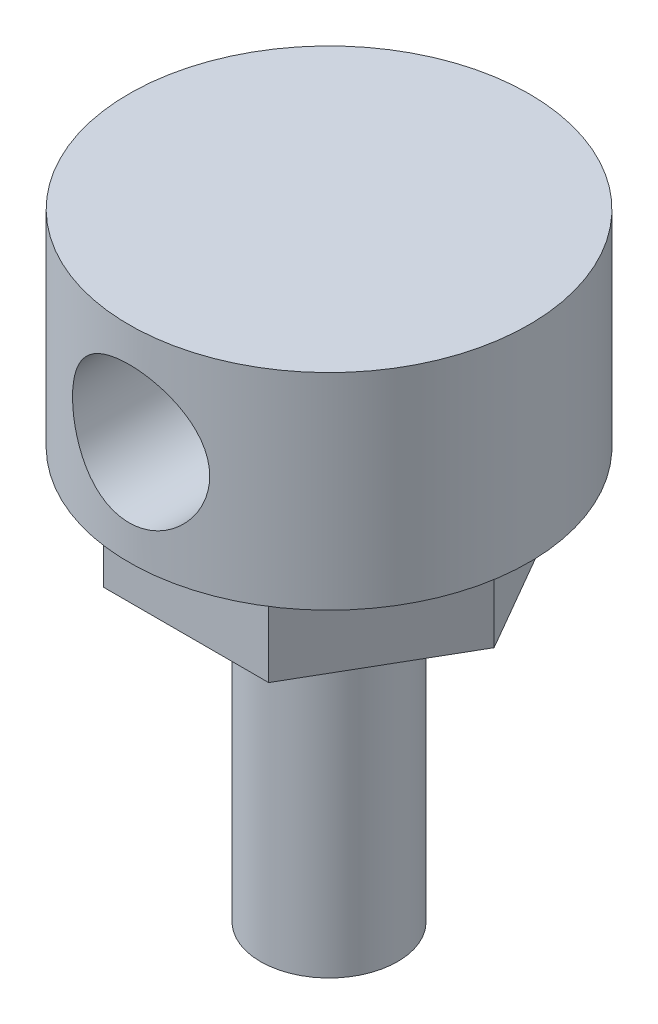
ISO-10303-21;
HEADER;
FILE_DESCRIPTION(('STEP AP214'),'2;1');
FILE_NAME('part.step','',(''),(''),'','','');
FILE_SCHEMA(('AUTOMOTIVE_DESIGN { 1 0 10303 214 1 1 1 1 }'));
ENDSEC;
DATA;
#1=APPLICATION_CONTEXT('core data for automotive mechanical design processes');
#2=APPLICATION_PROTOCOL_DEFINITION('international standard','automotive_design',2000,#1);
#3=PRODUCT_CONTEXT('',#1,'mechanical');
#4=PRODUCT('Part','Part','',(#3));
#5=PRODUCT_RELATED_PRODUCT_CATEGORY('part','',(#4));
#6=PRODUCT_DEFINITION_FORMATION('','',#4);
#7=PRODUCT_DEFINITION_CONTEXT('part definition',#1,'design');
#8=PRODUCT_DEFINITION('design','',#6,#7);
#9=PRODUCT_DEFINITION_SHAPE('','',#8);
#10=(LENGTH_UNIT() NAMED_UNIT(*) SI_UNIT(.MILLI.,.METRE.));
#11=(NAMED_UNIT(*) PLANE_ANGLE_UNIT() SI_UNIT($,.RADIAN.));
#12=(NAMED_UNIT(*) SI_UNIT($,.STERADIAN.) SOLID_ANGLE_UNIT());
#13=UNCERTAINTY_MEASURE_WITH_UNIT(LENGTH_MEASURE(1.E-05),#10,'distance_accuracy_value','');
#14=(GEOMETRIC_REPRESENTATION_CONTEXT(3) GLOBAL_UNCERTAINTY_ASSIGNED_CONTEXT((#13)) GLOBAL_UNIT_ASSIGNED_CONTEXT((#10,
#11,#12)) REPRESENTATION_CONTEXT('',''));
#15=CARTESIAN_POINT('',(0.,0.,0.));
#16=DIRECTION('',(0.,0.,1.));
#17=DIRECTION('',(1.,0.,0.));
#18=AXIS2_PLACEMENT_3D('',#15,#16,#17);
#19=CARTESIAN_POINT('',(7.21687836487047,8.,12.4999999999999));
#20=DIRECTION('',(-0.866025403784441,0.,-0.499999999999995));
#21=DIRECTION('',(-0.499999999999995,0.,0.866025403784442));
#22=AXIS2_PLACEMENT_3D('',#19,#20,#21);
#23=PLANE('',#22);
#24=DIRECTION('',(0.499999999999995,0.,-0.866025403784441));
#25=VECTOR('',#24,1.);
#26=CARTESIAN_POINT('',(7.21687836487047,0.,12.4999999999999));
#27=LINE('',#26,#25);
#28=CARTESIAN_POINT('',(7.21687836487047,0.,12.4999999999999));
#29=VERTEX_POINT('',#28);
#30=CARTESIAN_POINT('',(14.4337567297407,0.,0.));
#31=VERTEX_POINT('',#30);
#32=EDGE_CURVE('E144',#29,#31,#27,.T.);
#33=ORIENTED_EDGE('',*,*,#32,.T.);
#34=DIRECTION('',(0.,-1.,0.));
#35=VECTOR('',#34,1.);
#36=CARTESIAN_POINT('',(14.4337567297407,8.,0.));
#37=LINE('',#36,#35);
#38=CARTESIAN_POINT('',(14.4337567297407,8.,0.));
#39=VERTEX_POINT('',#38);
#40=EDGE_CURVE('E159',#39,#31,#37,.T.);
#41=ORIENTED_EDGE('',*,*,#40,.F.);
#42=DIRECTION('',(0.499999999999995,0.,-0.866025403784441));
#43=VECTOR('',#42,1.);
#44=CARTESIAN_POINT('',(7.21687836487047,8.,12.4999999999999));
#45=LINE('',#44,#43);
#46=CARTESIAN_POINT('',(7.21687836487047,8.,12.4999999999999));
#47=VERTEX_POINT('',#46);
#48=EDGE_CURVE('E135',#47,#39,#45,.T.);
#49=ORIENTED_EDGE('',*,*,#48,.F.);
#50=DIRECTION('',(0.,-1.,0.));
#51=VECTOR('',#50,1.);
#52=CARTESIAN_POINT('',(7.21687836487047,8.,12.4999999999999));
#53=LINE('',#52,#51);
#54=EDGE_CURVE('E143',#47,#29,#53,.T.);
#55=ORIENTED_EDGE('',*,*,#54,.T.);
#56=EDGE_LOOP('',(#33,#41,#49,#55));
#57=FACE_BOUND('',#56,.T.);
#58=ADVANCED_FACE('F46',(#57),#23,.F.);
#59=CARTESIAN_POINT('',(14.4337567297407,8.,0.));
#60=DIRECTION('',(-0.866025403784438,0.,0.500000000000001));
#61=DIRECTION('',(0.500000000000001,0.,0.866025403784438));
#62=AXIS2_PLACEMENT_3D('',#59,#60,#61);
#63=PLANE('',#62);
#64=DIRECTION('',(-0.500000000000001,0.,-0.866025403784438));
#65=VECTOR('',#64,1.);
#66=CARTESIAN_POINT('',(14.4337567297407,0.,0.));
#67=LINE('',#66,#65);
#68=CARTESIAN_POINT('',(7.2168783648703,0.,-12.5));
#69=VERTEX_POINT('',#68);
#70=EDGE_CURVE('E147',#31,#69,#67,.T.);
#71=ORIENTED_EDGE('',*,*,#70,.T.);
#72=DIRECTION('',(0.,-1.,0.));
#73=VECTOR('',#72,1.);
#74=CARTESIAN_POINT('',(7.2168783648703,8.,-12.5));
#75=LINE('',#74,#73);
#76=CARTESIAN_POINT('',(7.2168783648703,8.,-12.5));
#77=VERTEX_POINT('',#76);
#78=EDGE_CURVE('E122',#77,#69,#75,.T.);
#79=ORIENTED_EDGE('',*,*,#78,.F.);
#80=DIRECTION('',(-0.500000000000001,0.,-0.866025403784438));
#81=VECTOR('',#80,1.);
#82=CARTESIAN_POINT('',(14.4337567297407,8.,0.));
#83=LINE('',#82,#81);
#84=EDGE_CURVE('E103',#39,#77,#83,.T.);
#85=ORIENTED_EDGE('',*,*,#84,.F.);
#86=ORIENTED_EDGE('',*,*,#40,.T.);
#87=EDGE_LOOP('',(#71,#79,#85,#86));
#88=FACE_BOUND('',#87,.T.);
#89=ADVANCED_FACE('F199',(#88),#63,.F.);
#90=CARTESIAN_POINT('',(7.2168783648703,8.,-12.5));
#91=DIRECTION('',(0.,0.,1.));
#92=DIRECTION('',(1.,0.,0.));
#93=AXIS2_PLACEMENT_3D('',#90,#91,#92);
#94=PLANE('',#93);
#95=DIRECTION('',(-1.,0.,0.));
#96=VECTOR('',#95,1.);
#97=CARTESIAN_POINT('',(7.2168783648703,0.,-12.5));
#98=LINE('',#97,#96);
#99=CARTESIAN_POINT('',(-7.21687836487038,0.,-12.5));
#100=VERTEX_POINT('',#99);
#101=EDGE_CURVE('E119',#69,#100,#98,.T.);
#102=ORIENTED_EDGE('',*,*,#101,.T.);
#103=DIRECTION('',(0.,-1.,0.));
#104=VECTOR('',#103,1.);
#105=CARTESIAN_POINT('',(-7.21687836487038,8.,-12.5));
#106=LINE('',#105,#104);
#107=CARTESIAN_POINT('',(-7.21687836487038,8.,-12.5));
#108=VERTEX_POINT('',#107);
#109=EDGE_CURVE('E112',#108,#100,#106,.T.);
#110=ORIENTED_EDGE('',*,*,#109,.F.);
#111=DIRECTION('',(-1.,0.,0.));
#112=VECTOR('',#111,1.);
#113=CARTESIAN_POINT('',(7.2168783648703,8.,-12.5));
#114=LINE('',#113,#112);
#115=EDGE_CURVE('E117',#77,#108,#114,.T.);
#116=ORIENTED_EDGE('',*,*,#115,.F.);
#117=ORIENTED_EDGE('',*,*,#78,.T.);
#118=EDGE_LOOP('',(#102,#110,#116,#117));
#119=FACE_BOUND('',#118,.T.);
#120=ADVANCED_FACE('F114',(#119),#94,.F.);
#121=CARTESIAN_POINT('',(-7.21687836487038,8.,-12.5));
#122=DIRECTION('',(0.866025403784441,0.,0.499999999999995));
#123=DIRECTION('',(0.499999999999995,0.,-0.866025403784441));
#124=AXIS2_PLACEMENT_3D('',#121,#122,#123);
#125=PLANE('',#124);
#126=DIRECTION('',(-0.499999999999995,0.,0.866025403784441));
#127=VECTOR('',#126,1.);
#128=CARTESIAN_POINT('',(-7.21687836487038,0.,-12.5));
#129=LINE('',#128,#127);
#130=CARTESIAN_POINT('',(-14.4337567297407,0.,1.00790384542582E-13));
#131=VERTEX_POINT('',#130);
#132=EDGE_CURVE('E151',#100,#131,#129,.T.);
#133=ORIENTED_EDGE('',*,*,#132,.T.);
#134=DIRECTION('',(0.,-1.,0.));
#135=VECTOR('',#134,1.);
#136=CARTESIAN_POINT('',(-14.4337567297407,8.,1.00790384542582E-13));
#137=LINE('',#136,#135);
#138=CARTESIAN_POINT('',(-14.4337567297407,8.,1.00790384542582E-13));
#139=VERTEX_POINT('',#138);
#140=EDGE_CURVE('E123',#139,#131,#137,.T.);
#141=ORIENTED_EDGE('',*,*,#140,.F.);
#142=DIRECTION('',(-0.499999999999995,0.,0.866025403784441));
#143=VECTOR('',#142,1.);
#144=CARTESIAN_POINT('',(-7.21687836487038,8.,-12.5));
#145=LINE('',#144,#143);
#146=EDGE_CURVE('E126',#108,#139,#145,.T.);
#147=ORIENTED_EDGE('',*,*,#146,.F.);
#148=ORIENTED_EDGE('',*,*,#109,.T.);
#149=EDGE_LOOP('',(#133,#141,#147,#148));
#150=FACE_BOUND('',#149,.T.);
#151=ADVANCED_FACE('F127',(#150),#125,.F.);
#152=CARTESIAN_POINT('',(-14.4337567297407,8.,1.00790384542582E-13));
#153=DIRECTION('',(0.866025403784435,0.,-0.500000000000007));
#154=DIRECTION('',(-0.500000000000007,0.,-0.866025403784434));
#155=AXIS2_PLACEMENT_3D('',#152,#153,#154);
#156=PLANE('',#155);
#157=DIRECTION('',(0.500000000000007,0.,0.866025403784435));
#158=VECTOR('',#157,1.);
#159=CARTESIAN_POINT('',(-14.4337567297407,0.,1.00790384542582E-13));
#160=LINE('',#159,#158);
#161=CARTESIAN_POINT('',(-7.21687836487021,0.,12.5000000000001));
#162=VERTEX_POINT('',#161);
#163=EDGE_CURVE('E88',#131,#162,#160,.T.);
#164=ORIENTED_EDGE('',*,*,#163,.T.);
#165=DIRECTION('',(0.,-1.,0.));
#166=VECTOR('',#165,1.);
#167=CARTESIAN_POINT('',(-7.21687836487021,8.,12.5000000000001));
#168=LINE('',#167,#166);
#169=CARTESIAN_POINT('',(-7.21687836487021,8.,12.5000000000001));
#170=VERTEX_POINT('',#169);
#171=EDGE_CURVE('E66',#170,#162,#168,.T.);
#172=ORIENTED_EDGE('',*,*,#171,.F.);
#173=DIRECTION('',(0.500000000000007,0.,0.866025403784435));
#174=VECTOR('',#173,1.);
#175=CARTESIAN_POINT('',(-14.4337567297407,8.,1.00790384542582E-13));
#176=LINE('',#175,#174);
#177=EDGE_CURVE('E130',#139,#170,#176,.T.);
#178=ORIENTED_EDGE('',*,*,#177,.F.);
#179=ORIENTED_EDGE('',*,*,#140,.T.);
#180=EDGE_LOOP('',(#164,#172,#178,#179));
#181=FACE_BOUND('',#180,.T.);
#182=ADVANCED_FACE('F207',(#181),#156,.F.);
#183=CARTESIAN_POINT('',(-7.21687836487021,8.,12.5000000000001));
#184=DIRECTION('',(0.,0.,-1.));
#185=DIRECTION('',(-1.,0.,0.));
#186=AXIS2_PLACEMENT_3D('',#183,#184,#185);
#187=PLANE('',#186);
#188=DIRECTION('',(1.,0.,0.));
#189=VECTOR('',#188,1.);
#190=CARTESIAN_POINT('',(-7.21687836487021,0.,12.5000000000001));
#191=LINE('',#190,#189);
#192=EDGE_CURVE('E94',#162,#29,#191,.T.);
#193=ORIENTED_EDGE('',*,*,#192,.T.);
#194=ORIENTED_EDGE('',*,*,#54,.F.);
#195=DIRECTION('',(1.,0.,0.));
#196=VECTOR('',#195,1.);
#197=CARTESIAN_POINT('',(-7.21687836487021,8.,12.5000000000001));
#198=LINE('',#197,#196);
#199=EDGE_CURVE('E140',#170,#47,#198,.T.);
#200=ORIENTED_EDGE('',*,*,#199,.F.);
#201=ORIENTED_EDGE('',*,*,#171,.T.);
#202=EDGE_LOOP('',(#193,#194,#200,#201));
#203=FACE_BOUND('',#202,.T.);
#204=ADVANCED_FACE('F195',(#203),#187,.F.);
#205=CARTESIAN_POINT('',(0.,0.,0.));
#206=DIRECTION('',(0.,1.,0.));
#207=DIRECTION('',(0.,0.,1.));
#208=AXIS2_PLACEMENT_3D('',#205,#206,#207);
#209=PLANE('',#208);
#210=CARTESIAN_POINT('',(0.,0.,0.));
#211=DIRECTION('',(0.,1.,0.));
#212=DIRECTION('',(0.,0.,1.));
#213=AXIS2_PLACEMENT_3D('',#210,#211,#212);
#214=CIRCLE('',#213,6.);
#215=CARTESIAN_POINT('',(0.,0.,6.));
#216=VERTEX_POINT('',#215);
#217=EDGE_CURVE('E306',#216,#216,#214,.T.);
#218=ORIENTED_EDGE('',*,*,#217,.T.);
#219=EDGE_LOOP('',(#218));
#220=FACE_BOUND('',#219,.T.);
#221=ORIENTED_EDGE('',*,*,#32,.F.);
#222=ORIENTED_EDGE('',*,*,#192,.F.);
#223=ORIENTED_EDGE('',*,*,#163,.F.);
#224=ORIENTED_EDGE('',*,*,#132,.F.);
#225=ORIENTED_EDGE('',*,*,#101,.F.);
#226=ORIENTED_EDGE('',*,*,#70,.F.);
#227=EDGE_LOOP('',(#221,#222,#223,#224,#225,#226));
#228=FACE_BOUND('',#227,.T.);
#229=ADVANCED_FACE('F188',(#220,#228),#209,.F.);
#230=CARTESIAN_POINT('',(0.,8.,0.));
#231=DIRECTION('',(0.,-1.,0.));
#232=DIRECTION('',(0.,0.,-1.));
#233=AXIS2_PLACEMENT_3D('',#230,#231,#232);
#234=PLANE('',#233);
#235=CARTESIAN_POINT('',(0.,8.,0.));
#236=DIRECTION('',(0.,-1.,0.));
#237=DIRECTION('',(0.,0.,-1.));
#238=AXIS2_PLACEMENT_3D('',#235,#236,#237);
#239=CIRCLE('',#238,17.5);
#240=CARTESIAN_POINT('',(0.,8.,-17.5));
#241=VERTEX_POINT('',#240);
#242=EDGE_CURVE('E312',#241,#241,#239,.T.);
#243=ORIENTED_EDGE('',*,*,#242,.T.);
#244=EDGE_LOOP('',(#243));
#245=FACE_BOUND('',#244,.T.);
#246=ORIENTED_EDGE('',*,*,#48,.T.);
#247=ORIENTED_EDGE('',*,*,#84,.T.);
#248=ORIENTED_EDGE('',*,*,#115,.T.);
#249=ORIENTED_EDGE('',*,*,#146,.T.);
#250=ORIENTED_EDGE('',*,*,#177,.T.);
#251=ORIENTED_EDGE('',*,*,#199,.T.);
#252=EDGE_LOOP('',(#246,#247,#248,#249,#250,#251));
#253=FACE_BOUND('',#252,.T.);
#254=ADVANCED_FACE('F133',(#245,#253),#234,.T.);
#255=CARTESIAN_POINT('',(0.,26.,0.));
#256=DIRECTION('',(0.,-1.,0.));
#257=DIRECTION('',(0.,0.,-1.));
#258=AXIS2_PLACEMENT_3D('',#255,#256,#257);
#259=CYLINDRICAL_SURFACE('',#258,17.5);
#260=CARTESIAN_POINT('',(0.,23.,-17.5));
#261=CARTESIAN_POINT('',(0.163389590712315,23.000000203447,-17.5000001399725));
#262=CARTESIAN_POINT('',(0.326776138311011,22.9933206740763,-17.4977065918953));
#263=CARTESIAN_POINT('',(0.652391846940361,22.9666638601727,-17.488594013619));
#264=CARTESIAN_POINT('',(0.814620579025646,22.9466818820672,-17.4817733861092));
#265=CARTESIAN_POINT('',(1.13661475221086,22.8936171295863,-17.4637940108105));
#266=CARTESIAN_POINT('',(1.29638103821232,22.860538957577,-17.452636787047));
#267=CARTESIAN_POINT('',(1.61243727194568,22.7815732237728,-17.4262791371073));
#268=CARTESIAN_POINT('',(1.76872584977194,22.7356807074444,-17.4110771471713));
#269=CARTESIAN_POINT('',(2.07636915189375,22.6316076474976,-17.3770708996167));
#270=CARTESIAN_POINT('',(2.22773376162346,22.5734537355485,-17.3582744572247));
#271=CARTESIAN_POINT('',(2.52496271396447,22.4452520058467,-17.3175366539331));
#272=CARTESIAN_POINT('',(2.6708249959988,22.375199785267,-17.2955941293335));
#273=CARTESIAN_POINT('',(2.95607249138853,22.2237635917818,-17.2491308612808));
#274=CARTESIAN_POINT('',(3.09545894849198,22.1423818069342,-17.2246106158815));
#275=CARTESIAN_POINT('',(3.36702141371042,21.9688173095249,-17.1735920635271));
#276=CARTESIAN_POINT('',(3.49919480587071,21.8766307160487,-17.1470930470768));
#277=CARTESIAN_POINT('',(3.75971990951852,21.6789009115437,-17.091893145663));
#278=CARTESIAN_POINT('',(3.88780616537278,21.5730200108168,-17.0631486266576));
#279=CARTESIAN_POINT('',(4.13468315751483,21.3510858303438,-17.0050134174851));
#280=CARTESIAN_POINT('',(4.25347367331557,21.2350323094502,-16.9756227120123));
#281=CARTESIAN_POINT('',(4.48109269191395,20.9934153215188,-16.9169627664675));
#282=CARTESIAN_POINT('',(4.58991719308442,20.8678480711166,-16.8876935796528));
#283=CARTESIAN_POINT('',(4.79683730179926,20.6080358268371,-16.8300886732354));
#284=CARTESIAN_POINT('',(4.8949365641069,20.4737938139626,-16.8017526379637));
#285=CARTESIAN_POINT('',(5.08268823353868,20.1930667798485,-16.7459300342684));
#286=CARTESIAN_POINT('',(5.17198146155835,20.0463304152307,-16.7184975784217));
#287=CARTESIAN_POINT('',(5.3377987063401,19.7454327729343,-16.6662971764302));
#288=CARTESIAN_POINT('',(5.41432777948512,19.5912744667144,-16.641528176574));
#289=CARTESIAN_POINT('',(5.55403069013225,19.2764881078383,-16.5954258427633));
#290=CARTESIAN_POINT('',(5.61720233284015,19.1158589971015,-16.5740930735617));
#291=CARTESIAN_POINT('',(5.72956595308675,18.7893746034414,-16.5355860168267));
#292=CARTESIAN_POINT('',(5.77876437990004,18.6235217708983,-16.5184098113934));
#293=CARTESIAN_POINT('',(5.86125718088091,18.293657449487,-16.4893150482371));
#294=CARTESIAN_POINT('',(5.8950474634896,18.1297843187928,-16.4772336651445));
#295=CARTESIAN_POINT('',(5.94883595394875,17.7995745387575,-16.4578908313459));
#296=CARTESIAN_POINT('',(5.96883997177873,17.6332389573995,-16.4506273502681));
#297=CARTESIAN_POINT('',(5.9948669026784,17.299347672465,-16.4411606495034));
#298=CARTESIAN_POINT('',(6.00089101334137,17.1317920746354,-16.4389569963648));
#299=CARTESIAN_POINT('',(5.99889639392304,16.7967783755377,-16.4396850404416));
#300=CARTESIAN_POINT('',(5.99087809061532,16.6293202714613,-16.4426165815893));
#301=CARTESIAN_POINT('',(5.9616221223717,16.3040000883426,-16.4532454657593));
#302=CARTESIAN_POINT('',(5.94105099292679,16.146069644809,-16.4607024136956));
#303=CARTESIAN_POINT('',(5.88747410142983,15.8325461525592,-16.4799410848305));
#304=CARTESIAN_POINT('',(5.85446416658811,15.676953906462,-16.4917242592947));
#305=CARTESIAN_POINT('',(5.77631897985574,15.3692547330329,-16.5192569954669));
#306=CARTESIAN_POINT('',(5.73118707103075,15.2171468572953,-16.5350054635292));
#307=CARTESIAN_POINT('',(5.62915620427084,14.917287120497,-16.5700183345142));
#308=CARTESIAN_POINT('',(5.57225277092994,14.769536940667,-16.5892840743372));
#309=CARTESIAN_POINT('',(5.44610761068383,14.4769652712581,-16.6311273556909));
#310=CARTESIAN_POINT('',(5.37667900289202,14.3322314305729,-16.6537539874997));
#311=CARTESIAN_POINT('',(5.22662395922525,14.0490528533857,-16.7014549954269));
#312=CARTESIAN_POINT('',(5.14599370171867,13.9106102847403,-16.726530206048));
#313=CARTESIAN_POINT('',(4.97409227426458,13.6408348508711,-16.7784524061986));
#314=CARTESIAN_POINT('',(4.88282026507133,13.5095025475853,-16.8052995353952));
#315=CARTESIAN_POINT('',(4.69020928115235,13.2546764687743,-16.8600699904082));
#316=CARTESIAN_POINT('',(4.58886992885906,13.1311829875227,-16.887993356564));
#317=CARTESIAN_POINT('',(4.37080702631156,12.8860688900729,-16.9457800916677));
#318=CARTESIAN_POINT('',(4.25354109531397,12.764935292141,-16.9756649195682));
#319=CARTESIAN_POINT('',(4.00922102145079,12.5329521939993,-17.0350210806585));
#320=CARTESIAN_POINT('',(3.88216995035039,12.4220994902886,-17.0644925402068));
#321=CARTESIAN_POINT('',(3.61895574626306,12.2113049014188,-17.1222463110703));
#322=CARTESIAN_POINT('',(3.48278820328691,12.1113683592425,-17.1505280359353));
#323=CARTESIAN_POINT('',(3.20229046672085,11.9232052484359,-17.2051079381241));
#324=CARTESIAN_POINT('',(3.05796354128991,11.8349740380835,-17.2314068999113));
#325=CARTESIAN_POINT('',(2.76030824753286,11.6698977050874,-17.2816010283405));
#326=CARTESIAN_POINT('',(2.606895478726,11.5931951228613,-17.3054650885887));
#327=CARTESIAN_POINT('',(2.29370601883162,11.4530792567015,-17.3497524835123));
#328=CARTESIAN_POINT('',(2.13393183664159,11.3896607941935,-17.3701771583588));
#329=CARTESIAN_POINT('',(1.80912555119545,11.2766593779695,-17.4070035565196));
#330=CARTESIAN_POINT('',(1.64409395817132,11.2270750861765,-17.423405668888));
#331=CARTESIAN_POINT('',(1.31001358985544,11.1422220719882,-17.4517036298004));
#332=CARTESIAN_POINT('',(1.14096501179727,11.1069526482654,-17.4635996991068));
#333=CARTESIAN_POINT('',(0.80796141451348,11.0523654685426,-17.4820974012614));
#334=CARTESIAN_POINT('',(0.644125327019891,11.0323940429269,-17.4889155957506));
#335=CARTESIAN_POINT('',(0.315240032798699,11.0060166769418,-17.4979336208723));
#336=CARTESIAN_POINT('',(0.150190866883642,10.9996102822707,-17.5001336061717));
#337=CARTESIAN_POINT('',(-0.179842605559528,11.0004263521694,-17.4998538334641));
#338=CARTESIAN_POINT('',(-0.344826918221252,11.0076466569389,-17.497374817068));
#339=CARTESIAN_POINT('',(-0.673505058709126,11.0356397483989,-17.487807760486));
#340=CARTESIAN_POINT('',(-0.837198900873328,11.0564123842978,-17.4807197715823));
#341=CARTESIAN_POINT('',(-1.1569991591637,11.1104476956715,-17.4624226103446));
#342=CARTESIAN_POINT('',(-1.31318291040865,11.1433002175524,-17.4513489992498));
#343=CARTESIAN_POINT('',(-1.62218787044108,11.2212540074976,-17.4253423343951));
#344=CARTESIAN_POINT('',(-1.7750079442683,11.2663593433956,-17.4104079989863));
#345=CARTESIAN_POINT('',(-2.07619695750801,11.3684208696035,-17.3770641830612));
#346=CARTESIAN_POINT('',(-2.22456708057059,11.4253738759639,-17.3586556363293));
#347=CARTESIAN_POINT('',(-2.51603746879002,11.5507126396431,-17.31881065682));
#348=CARTESIAN_POINT('',(-2.65913571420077,11.6191027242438,-17.2973730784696));
#349=CARTESIAN_POINT('',(-2.94291064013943,11.7687771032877,-17.2513908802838));
#350=CARTESIAN_POINT('',(-3.08342026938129,11.8503572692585,-17.2267785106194));
#351=CARTESIAN_POINT('',(-3.35715286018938,12.0244751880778,-17.1755327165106));
#352=CARTESIAN_POINT('',(-3.49037328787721,12.1170167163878,-17.1488985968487));
#353=CARTESIAN_POINT('',(-3.74873071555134,12.312436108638,-17.0942813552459));
#354=CARTESIAN_POINT('',(-3.87386683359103,12.4153150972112,-17.0662980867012));
#355=CARTESIAN_POINT('',(-4.11533777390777,12.6307690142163,-17.0096848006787));
#356=CARTESIAN_POINT('',(-4.23167234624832,12.7433442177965,-16.9810547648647));
#357=CARTESIAN_POINT('',(-4.46028931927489,12.9832125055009,-16.922482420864));
#358=CARTESIAN_POINT('',(-4.57210228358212,13.1109544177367,-16.892543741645));
#359=CARTESIAN_POINT('',(-4.78456373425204,13.3755376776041,-16.8336004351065));
#360=CARTESIAN_POINT('',(-4.8852158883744,13.5123760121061,-16.8045955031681));
#361=CARTESIAN_POINT('',(-5.07474821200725,13.7944098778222,-16.7483345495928));
#362=CARTESIAN_POINT('',(-5.16362325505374,13.9396090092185,-16.7210792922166));
#363=CARTESIAN_POINT('',(-5.32884966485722,14.2373323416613,-16.6691589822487));
#364=CARTESIAN_POINT('',(-5.40520626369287,14.3898534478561,-16.6444928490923));
#365=CARTESIAN_POINT('',(-5.5447830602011,14.7012022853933,-16.5985174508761));
#366=CARTESIAN_POINT('',(-5.60800916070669,14.8600271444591,-16.5772066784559));
#367=CARTESIAN_POINT('',(-5.72077524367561,15.1828724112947,-16.5386300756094));
#368=CARTESIAN_POINT('',(-5.7703208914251,15.3468906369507,-16.5213625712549));
#369=CARTESIAN_POINT('',(-5.85526622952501,15.6789331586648,-16.4914489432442));
#370=CARTESIAN_POINT('',(-5.89066871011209,15.8469566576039,-16.4788019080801));
#371=CARTESIAN_POINT('',(-5.94696706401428,16.1857153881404,-16.4585686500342));
#372=CARTESIAN_POINT('',(-5.9678637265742,16.3564504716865,-16.4509821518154));
#373=CARTESIAN_POINT('',(-5.99418547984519,16.6898901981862,-16.4414087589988));
#374=CARTESIAN_POINT('',(-6.00039147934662,16.8525255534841,-16.4391393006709));
#375=CARTESIAN_POINT('',(-5.99957016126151,17.1778162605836,-16.4394391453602));
#376=CARTESIAN_POINT('',(-5.99253835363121,17.3404716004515,-16.4420100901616));
#377=CARTESIAN_POINT('',(-5.96530939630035,17.6644548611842,-16.4519084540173));
#378=CARTESIAN_POINT('',(-5.94511808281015,17.8257833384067,-16.4592337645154));
#379=CARTESIAN_POINT('',(-5.8917650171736,18.1460681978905,-16.478407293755));
#380=CARTESIAN_POINT('',(-5.85859839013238,18.3050236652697,-16.4902572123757));
#381=CARTESIAN_POINT('',(-5.78046684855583,18.6159646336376,-16.5178048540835));
#382=CARTESIAN_POINT('',(-5.7357737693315,18.7680265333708,-16.5334134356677));
#383=CARTESIAN_POINT('',(-5.63463461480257,19.0678323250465,-16.5681547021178));
#384=CARTESIAN_POINT('',(-5.57818438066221,19.2155746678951,-16.5872886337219));
#385=CARTESIAN_POINT('',(-5.45399262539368,19.5057673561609,-16.6285369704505));
#386=CARTESIAN_POINT('',(-5.38625307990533,19.6482186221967,-16.6506508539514));
#387=CARTESIAN_POINT('',(-5.23993629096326,19.9270929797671,-16.6972741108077));
#388=CARTESIAN_POINT('',(-5.16135514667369,20.0635138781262,-16.7217843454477));
#389=CARTESIAN_POINT('',(-4.9900743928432,20.3355899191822,-16.773715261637));
#390=CARTESIAN_POINT('',(-4.89689494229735,20.4709275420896,-16.8012176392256));
#391=CARTESIAN_POINT('',(-4.69988721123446,20.7333609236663,-16.8573885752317));
#392=CARTESIAN_POINT('',(-4.59605853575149,20.8604563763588,-16.8860571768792));
#393=CARTESIAN_POINT('',(-4.37834895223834,21.1057227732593,-16.943811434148));
#394=CARTESIAN_POINT('',(-4.26446377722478,21.2238898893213,-16.9728972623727));
#395=CARTESIAN_POINT('',(-4.02739221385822,21.4505048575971,-17.0307073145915));
#396=CARTESIAN_POINT('',(-3.90420885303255,21.5589558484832,-17.0594316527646));
#397=CARTESIAN_POINT('',(-3.64378228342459,21.7699175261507,-17.1169909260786));
#398=CARTESIAN_POINT('',(-3.50616368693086,21.8719784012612,-17.1457784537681));
#399=CARTESIAN_POINT('',(-3.22247595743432,22.0640876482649,-17.2013525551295));
#400=CARTESIAN_POINT('',(-3.07641000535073,22.1541405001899,-17.2281398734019));
#401=CARTESIAN_POINT('',(-2.77668905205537,22.321604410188,-17.2789786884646));
#402=CARTESIAN_POINT('',(-2.62303200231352,22.3990120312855,-17.3030294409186));
#403=CARTESIAN_POINT('',(-2.30928262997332,22.5404702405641,-17.3476887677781));
#404=CARTESIAN_POINT('',(-2.14919319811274,22.6045267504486,-17.3682988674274));
#405=CARTESIAN_POINT('',(-1.82776727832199,22.7173019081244,-17.405021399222));
#406=CARTESIAN_POINT('',(-1.66656335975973,22.7663657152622,-17.4212338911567));
#407=CARTESIAN_POINT('',(-1.34030929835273,22.8508076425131,-17.4493657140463));
#408=CARTESIAN_POINT('',(-1.1752607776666,22.8861914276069,-17.4612868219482));
#409=CARTESIAN_POINT('',(-0.84251523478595,22.9429497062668,-17.4805016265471));
#410=CARTESIAN_POINT('',(-0.674818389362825,22.9643251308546,-17.4877956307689));
#411=CARTESIAN_POINT('',(-0.338079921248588,22.9928499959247,-17.4975446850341));
#412=CARTESIAN_POINT('',(-0.169038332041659,22.9999997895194,-17.4999998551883));
#413=CARTESIAN_POINT('',(0.,23.,-17.5));
#414=B_SPLINE_CURVE_WITH_KNOTS('',3,(#260,#261,#262,#263,#264,#265,#266,#267,#268,#269,#270,
#271,#272,#273,#274,#275,#276,#277,#278,#279,#280,#281,#282,#283,#284,#285,#286,#287,#288,#289,
#290,#291,#292,#293,#294,#295,#296,#297,#298,#299,#300,#301,#302,#303,#304,#305,#306,#307,#308,
#309,#310,#311,#312,#313,#314,#315,#316,#317,#318,#319,#320,#321,#322,#323,#324,#325,#326,#327,
#328,#329,#330,#331,#332,#333,#334,#335,#336,#337,#338,#339,#340,#341,#342,#343,#344,#345,#346,
#347,#348,#349,#350,#351,#352,#353,#354,#355,#356,#357,#358,#359,#360,#361,#362,#363,#364,#365,
#366,#367,#368,#369,#370,#371,#372,#373,#374,#375,#376,#377,#378,#379,#380,#381,#382,#383,#384,
#385,#386,#387,#388,#389,#390,#391,#392,#393,#394,#395,#396,#397,#398,#399,#400,#401,#402,#403,
#404,#405,#406,#407,#408,#409,#410,#411,#412,#413),.UNSPECIFIED.,.T.,.F.,(4,2,2,2,2,2,2,2,2,2,2,
2,2,2,2,2,2,2,2,2,2,2,2,2,2,2,2,2,2,2,2,2,2,2,2,2,2,2,2,2,2,2,2,2,2,2,2,2,2,2,2,2,2,2,2,2,2,2,2,
2,2,2,2,2,2,2,2,2,2,2,2,2,2,2,2,2,4),(0.,0.490011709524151,0.980196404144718,1.47020898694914,
1.9604112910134,2.44955964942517,2.93888940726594,3.42812479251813,3.91753644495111,
4.4229186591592,4.92831285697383,5.4339091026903,5.93933251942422,6.46053012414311,
6.98152076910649,7.50259695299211,8.02343224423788,8.52605774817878,9.02847129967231,
9.5308418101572,10.033197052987,10.5109535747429,10.9888705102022,11.4666557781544,
11.9446230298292,12.4304215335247,12.9163861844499,13.402389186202,13.8884104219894,
14.4014894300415,14.9144080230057,15.4275765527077,15.940540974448,16.4594018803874,
16.9780601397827,17.4966682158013,18.0152508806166,18.5102019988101,19.0051365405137,
19.4999926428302,19.9948432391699,20.4742457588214,20.9538076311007,21.4332407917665,
21.9128557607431,22.4052946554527,22.8979036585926,23.3905663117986,23.8832429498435,
24.3997905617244,24.9161679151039,25.4327693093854,25.9491542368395,26.4653065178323,
26.9812447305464,27.4970811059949,28.0128894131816,28.5005949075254,28.9884658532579,
29.4761205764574,29.9639586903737,30.4412035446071,30.9186175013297,31.3959479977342,
31.8734506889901,32.3726889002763,32.8719456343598,33.3714152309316,33.870722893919,
34.3912991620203,34.9116806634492,35.4322033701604,35.9524947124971,36.459703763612,
36.9667025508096,37.4736676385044,37.9806201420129),.UNSPECIFIED.);
#415=CARTESIAN_POINT('',(0.,23.,-17.5));
#416=VERTEX_POINT('',#415);
#417=EDGE_CURVE('E13',#416,#416,#414,.T.);
#418=ORIENTED_EDGE('',*,*,#417,.F.);
#419=EDGE_LOOP('',(#418));
#420=FACE_BOUND('',#419,.T.);
#421=CARTESIAN_POINT('',(6.,17.,16.4392822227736));
#422=CARTESIAN_POINT('',(6.0000002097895,17.1630704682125,16.4392820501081));
#423=CARTESIAN_POINT('',(5.99334652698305,17.326137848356,16.4417151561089));
#424=CARTESIAN_POINT('',(5.96679536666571,17.6511061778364,16.4513693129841));
#425=CARTESIAN_POINT('',(5.94689317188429,17.8130066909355,16.4585920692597));
#426=CARTESIAN_POINT('',(5.8940459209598,18.1343405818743,16.4775910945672));
#427=CARTESIAN_POINT('',(5.8611046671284,18.2937746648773,16.4893660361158));
#428=CARTESIAN_POINT('',(5.78247648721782,18.6091579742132,16.5171032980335));
#429=CARTESIAN_POINT('',(5.73678456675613,18.7651058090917,16.5330672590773));
#430=CARTESIAN_POINT('',(5.63319566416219,19.0720219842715,16.5686479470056));
#431=CARTESIAN_POINT('',(5.57532925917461,19.2230017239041,16.5882555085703));
#432=CARTESIAN_POINT('',(5.4477724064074,19.5194902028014,16.6305829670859));
#433=CARTESIAN_POINT('',(5.37807756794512,19.6649968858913,16.6533040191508));
#434=CARTESIAN_POINT('',(5.22741263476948,19.9495892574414,16.7012095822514));
#435=CARTESIAN_POINT('',(5.14644446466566,20.0886760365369,16.7263936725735));
#436=CARTESIAN_POINT('',(4.97374771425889,20.3597121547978,16.7785568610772));
#437=CARTESIAN_POINT('',(4.88201526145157,20.4916589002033,16.8055366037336));
#438=CARTESIAN_POINT('',(4.68476080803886,20.7524305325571,16.8616107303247));
#439=CARTESIAN_POINT('',(4.5788509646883,20.8809533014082,16.8907464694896));
#440=CARTESIAN_POINT('',(4.35676694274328,21.128711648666,16.949388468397));
#441=CARTESIAN_POINT('',(4.24059255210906,21.2479470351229,16.9788947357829));
#442=CARTESIAN_POINT('',(3.99864232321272,21.4764445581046,17.0374984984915));
#443=CARTESIAN_POINT('',(3.87286319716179,21.5857032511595,17.0665958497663));
#444=CARTESIAN_POINT('',(3.61253423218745,21.7934665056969,17.1235902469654));
#445=CARTESIAN_POINT('',(3.47798746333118,21.8919747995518,17.1514877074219));
#446=CARTESIAN_POINT('',(3.19696959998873,22.0802350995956,17.2061164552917));
#447=CARTESIAN_POINT('',(3.05026898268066,22.1696610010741,17.2327925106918));
#448=CARTESIAN_POINT('',(2.74942302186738,22.3357458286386,17.283342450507));
#449=CARTESIAN_POINT('',(2.59528065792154,22.4124098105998,17.3072174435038));
#450=CARTESIAN_POINT('',(2.28052223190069,22.5523768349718,17.3514978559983));
#451=CARTESIAN_POINT('',(2.11990492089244,22.6156772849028,17.3719026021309));
#452=CARTESIAN_POINT('',(1.79346074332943,22.7282889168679,17.4086317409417));
#453=CARTESIAN_POINT('',(1.6276362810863,22.7776064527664,17.4249579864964));
#454=CARTESIAN_POINT('',(1.29806992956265,22.8602749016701,17.4525459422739));
#455=CARTESIAN_POINT('',(1.13447047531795,22.894139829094,17.4639697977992));
#456=CARTESIAN_POINT('',(0.80483212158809,22.9481194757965,17.4822618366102));
#457=CARTESIAN_POINT('',(0.638794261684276,22.9682398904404,17.4891319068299));
#458=CARTESIAN_POINT('',(0.305496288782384,22.9945488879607,17.4981274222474));
#459=CARTESIAN_POINT('',(0.138236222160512,23.0007379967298,17.5002530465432));
#460=CARTESIAN_POINT('',(-0.196206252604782,22.9991219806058,17.4996989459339));
#461=CARTESIAN_POINT('',(-0.363388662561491,22.9913172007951,17.4970193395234));
#462=CARTESIAN_POINT('',(-0.689423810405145,22.9624116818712,17.487143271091));
#463=CARTESIAN_POINT('',(-0.848333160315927,22.9418790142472,17.4801398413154));
#464=CARTESIAN_POINT('',(-1.1638240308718,22.8882191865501,17.4619726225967));
#465=CARTESIAN_POINT('',(-1.32040474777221,22.8550877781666,17.4508074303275));
#466=CARTESIAN_POINT('',(-1.63006378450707,22.7765387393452,17.4246099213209));
#467=CARTESIAN_POINT('',(-1.78314322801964,22.7311251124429,17.4095788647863));
#468=CARTESIAN_POINT('',(-2.0849116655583,22.6283709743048,17.3760237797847));
#469=CARTESIAN_POINT('',(-2.23359897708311,22.5710259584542,17.3574984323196));
#470=CARTESIAN_POINT('',(-2.52751919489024,22.4440436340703,17.3171574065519));
#471=CARTESIAN_POINT('',(-2.67268110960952,22.3742548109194,17.2953017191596));
#472=CARTESIAN_POINT('',(-2.95666007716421,22.223410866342,17.2490251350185));
#473=CARTESIAN_POINT('',(-3.09547493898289,22.142351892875,17.2246033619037));
#474=CARTESIAN_POINT('',(-3.36591516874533,21.9695439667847,17.1738041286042));
#475=CARTESIAN_POINT('',(-3.49754007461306,21.8777943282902,17.1474265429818));
#476=CARTESIAN_POINT('',(-3.75285929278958,21.6841986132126,17.093363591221));
#477=CARTESIAN_POINT('',(-3.87655329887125,21.582352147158,17.0656781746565));
#478=CARTESIAN_POINT('',(-4.12128157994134,21.3638593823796,17.0082807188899));
#479=CARTESIAN_POINT('',(-4.24187601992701,21.2467284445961,16.9785364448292));
#480=CARTESIAN_POINT('',(-4.4727926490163,21.0027897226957,16.9191707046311));
#481=CARTESIAN_POINT('',(-4.58311801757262,20.8759849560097,16.8895492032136));
#482=CARTESIAN_POINT('',(-4.79289718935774,20.6133634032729,16.8312209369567));
#483=CARTESIAN_POINT('',(-4.8923450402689,20.4775417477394,16.802514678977));
#484=CARTESIAN_POINT('',(-5.07958864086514,20.1978263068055,16.7468599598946));
#485=CARTESIAN_POINT('',(-5.16738893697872,20.0539357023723,16.7199108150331));
#486=CARTESIAN_POINT('',(-5.33207368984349,19.756511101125,16.6681302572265));
#487=CARTESIAN_POINT('',(-5.40875646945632,19.6028579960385,16.6433406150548));
#488=CARTESIAN_POINT('',(-5.54880077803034,19.2891701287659,16.597175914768));
#489=CARTESIAN_POINT('',(-5.61216753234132,19.1291378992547,16.575799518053));
#490=CARTESIAN_POINT('',(-5.72502933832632,18.8037957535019,16.537158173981));
#491=CARTESIAN_POINT('',(-5.77452665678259,18.6384867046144,16.5198925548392));
#492=CARTESIAN_POINT('',(-5.85916726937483,18.3038194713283,16.4900629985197));
#493=CARTESIAN_POINT('',(-5.8943113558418,18.1344615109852,16.477498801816));
#494=CARTESIAN_POINT('',(-5.94855511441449,17.8011471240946,16.4579914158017));
#495=CARTESIAN_POINT('',(-5.96833655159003,17.6373153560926,16.4508099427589));
#496=CARTESIAN_POINT('',(-5.99433649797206,17.3084401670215,16.4413540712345));
#497=CARTESIAN_POINT('',(-6.00055552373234,17.1433967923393,16.4390794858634));
#498=CARTESIAN_POINT('',(-5.99936668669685,16.8133950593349,16.4395133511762));
#499=CARTESIAN_POINT('',(-5.99196115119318,16.6484366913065,16.4422209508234));
#500=CARTESIAN_POINT('',(-5.96360480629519,16.3198450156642,16.4525269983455));
#501=CARTESIAN_POINT('',(-5.94265418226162,16.1562116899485,16.4601253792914));
#502=CARTESIAN_POINT('',(-5.8884536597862,15.8375667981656,16.4795906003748));
#503=CARTESIAN_POINT('',(-5.8556920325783,15.6824613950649,16.4912875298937));
#504=CARTESIAN_POINT('',(-5.77809602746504,15.3756046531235,16.5186348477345));
#505=CARTESIAN_POINT('',(-5.73325766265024,15.2238544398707,16.5342865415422));
#506=CARTESIAN_POINT('',(-5.63190137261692,14.924761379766,16.5690842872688));
#507=CARTESIAN_POINT('',(-5.57538601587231,14.7774175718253,16.5882295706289));
#508=CARTESIAN_POINT('',(-5.45108618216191,14.4879324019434,16.629490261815));
#509=CARTESIAN_POINT('',(-5.38329741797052,14.3457930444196,16.6516067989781));
#510=CARTESIAN_POINT('',(-5.234552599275,14.0630275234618,16.6989744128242));
#511=CARTESIAN_POINT('',(-5.15323830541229,13.9226030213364,16.7243043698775));
#512=CARTESIAN_POINT('',(-4.97965953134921,13.6489927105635,16.7768057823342));
#513=CARTESIAN_POINT('',(-4.8873912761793,13.5158094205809,16.8039778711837));
#514=CARTESIAN_POINT('',(-4.6925082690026,13.2574676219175,16.8594373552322));
#515=CARTESIAN_POINT('',(-4.58989244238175,13.132309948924,16.8877248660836));
#516=CARTESIAN_POINT('',(-4.37493801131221,12.8907348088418,16.944682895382));
#517=CARTESIAN_POINT('',(-4.26259916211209,12.7743175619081,16.9733534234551));
#518=CARTESIAN_POINT('',(-4.02280316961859,12.5451192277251,17.0318248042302));
#519=CARTESIAN_POINT('',(-3.89486492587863,12.43283620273,17.0616075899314));
#520=CARTESIAN_POINT('',(-3.62978885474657,12.2194589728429,17.1199603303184));
#521=CARTESIAN_POINT('',(-3.49265410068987,12.1183610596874,17.1485306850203));
#522=CARTESIAN_POINT('',(-3.20994761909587,11.9279898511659,17.2036909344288));
#523=CARTESIAN_POINT('',(-3.06437264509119,11.838721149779,17.2302800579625));
#524=CARTESIAN_POINT('',(-2.76583632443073,11.6727773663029,17.2807133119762));
#525=CARTESIAN_POINT('',(-2.61287812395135,11.5960969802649,17.3045585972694));
#526=CARTESIAN_POINT('',(-2.30143897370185,11.4563239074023,17.3487166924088));
#527=CARTESIAN_POINT('',(-2.14299427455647,11.3931566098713,17.3690487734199));
#528=CARTESIAN_POINT('',(-1.82095172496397,11.2804524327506,17.4057572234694));
#529=CARTESIAN_POINT('',(-1.65735601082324,11.2309099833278,17.4221352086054));
#530=CARTESIAN_POINT('',(-1.32618770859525,11.1459034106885,17.4504681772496));
#531=CARTESIAN_POINT('',(-1.15861557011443,11.1104377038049,17.4624236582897));
#532=CARTESIAN_POINT('',(-0.820788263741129,11.0539397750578,17.48155952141));
#533=CARTESIAN_POINT('',(-0.650533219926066,11.0329068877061,17.4887401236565));
#534=CARTESIAN_POINT('',(-0.317220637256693,11.0061765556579,17.4978790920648));
#535=CARTESIAN_POINT('',(-0.154226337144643,10.9997683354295,17.5000794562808));
#536=CARTESIAN_POINT('',(0.171798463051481,11.0002445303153,17.499916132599));
#537=CARTESIAN_POINT('',(0.334828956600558,11.0071334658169,17.4975508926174));
#538=CARTESIAN_POINT('',(0.659583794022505,11.0341398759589,17.4883197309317));
#539=CARTESIAN_POINT('',(0.821308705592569,11.0542512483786,17.481455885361));
#540=CARTESIAN_POINT('',(1.14241261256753,11.1075141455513,17.4634121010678));
#541=CARTESIAN_POINT('',(1.30179070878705,11.140670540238,17.4522305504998));
#542=CARTESIAN_POINT('',(1.61416679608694,11.2190029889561,17.4260893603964));
#543=CARTESIAN_POINT('',(1.767228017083,11.2639513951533,17.411201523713));
#544=CARTESIAN_POINT('',(2.06900037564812,11.3657648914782,17.3779253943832));
#545=CARTESIAN_POINT('',(2.21770994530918,11.4226342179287,17.3595358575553));
#546=CARTESIAN_POINT('',(2.50976737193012,11.5478164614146,17.3197224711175));
#547=CARTESIAN_POINT('',(2.65311638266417,11.6161268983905,17.2982992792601));
#548=CARTESIAN_POINT('',(2.93369200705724,11.7637237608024,17.2529318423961));
#549=CARTESIAN_POINT('',(3.07091640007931,11.8430141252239,17.2289866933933));
#550=CARTESIAN_POINT('',(3.34351240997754,12.0152335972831,17.1782092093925));
#551=CARTESIAN_POINT('',(3.47861469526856,12.1085669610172,17.1513016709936));
#552=CARTESIAN_POINT('',(3.74054432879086,12.3058322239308,17.0960886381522));
#553=CARTESIAN_POINT('',(3.86737136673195,12.4097645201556,17.0677830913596));
#554=CARTESIAN_POINT('',(4.11207253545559,12.6276200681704,17.0104867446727));
#555=CARTESIAN_POINT('',(4.22994255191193,12.7415478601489,16.9814956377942));
#556=CARTESIAN_POINT('',(4.45594184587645,12.9786325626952,16.9235985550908));
#557=CARTESIAN_POINT('',(4.56407421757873,13.1017865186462,16.8946925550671));
#558=CARTESIAN_POINT('',(4.77437334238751,13.3620708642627,16.8365009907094));
#559=CARTESIAN_POINT('',(4.87609069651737,13.4995729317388,16.8072515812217));
#560=CARTESIAN_POINT('',(5.06753124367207,13.782958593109,16.7505252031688));
#561=CARTESIAN_POINT('',(5.15725888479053,13.928839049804,16.7230475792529));
#562=CARTESIAN_POINT('',(5.32411079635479,14.2281403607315,16.6706777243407));
#563=CARTESIAN_POINT('',(5.40123162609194,14.3815632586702,16.6457861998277));
#564=CARTESIAN_POINT('',(5.54216837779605,14.694820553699,16.5993938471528));
#565=CARTESIAN_POINT('',(5.60599024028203,14.8546520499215,16.5778915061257));
#566=CARTESIAN_POINT('',(5.71833755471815,15.1755092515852,16.5394695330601));
#567=CARTESIAN_POINT('',(5.76721168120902,15.3364004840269,16.5224469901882));
#568=CARTESIAN_POINT('',(5.85133566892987,15.6620403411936,16.4928427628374));
#569=CARTESIAN_POINT('',(5.88659125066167,15.8267873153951,16.4802592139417));
#570=CARTESIAN_POINT('',(5.94314603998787,16.1589347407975,16.4599489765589));
#571=CARTESIAN_POINT('',(5.96444718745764,16.3263348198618,16.4522216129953));
#572=CARTESIAN_POINT('',(5.99287387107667,16.6624910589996,16.4418883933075));
#573=CARTESIAN_POINT('',(5.99999978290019,16.8312471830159,16.4392824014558));
#574=CARTESIAN_POINT('',(6.,17.,16.4392822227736));
#575=B_SPLINE_CURVE_WITH_KNOTS('',3,(#421,#422,#423,#424,#425,#426,#427,#428,#429,#430,#431,
#432,#433,#434,#435,#436,#437,#438,#439,#440,#441,#442,#443,#444,#445,#446,#447,#448,#449,#450,
#451,#452,#453,#454,#455,#456,#457,#458,#459,#460,#461,#462,#463,#464,#465,#466,#467,#468,#469,
#470,#471,#472,#473,#474,#475,#476,#477,#478,#479,#480,#481,#482,#483,#484,#485,#486,#487,#488,
#489,#490,#491,#492,#493,#494,#495,#496,#497,#498,#499,#500,#501,#502,#503,#504,#505,#506,#507,
#508,#509,#510,#511,#512,#513,#514,#515,#516,#517,#518,#519,#520,#521,#522,#523,#524,#525,#526,
#527,#528,#529,#530,#531,#532,#533,#534,#535,#536,#537,#538,#539,#540,#541,#542,#543,#544,#545,
#546,#547,#548,#549,#550,#551,#552,#553,#554,#555,#556,#557,#558,#559,#560,#561,#562,#563,#564,
#565,#566,#567,#568,#569,#570,#571,#572,#573,#574),.UNSPECIFIED.,.T.,.F.,(4,2,2,2,2,2,2,2,2,2,2,
2,2,2,2,2,2,2,2,2,2,2,2,2,2,2,2,2,2,2,2,2,2,2,2,2,2,2,2,2,2,2,2,2,2,2,2,2,2,2,2,2,2,2,2,2,2,2,2,
2,2,2,2,2,2,2,2,2,2,2,2,2,2,2,2,2,4),(0.,0.489053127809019,0.978280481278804,1.46736527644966,
1.95664191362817,2.44470405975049,2.93294777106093,3.42110823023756,3.90944484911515,
4.41607526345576,4.92271614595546,5.42953124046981,5.93616981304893,6.45712530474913,
6.97787391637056,7.49872345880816,8.01933594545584,8.52107494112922,9.02260590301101,
9.5241179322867,10.0256175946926,10.5062026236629,10.9869498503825,11.4675405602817,
11.9483130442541,12.435398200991,12.9226502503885,13.4099335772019,13.897235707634,
14.4088254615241,14.9202562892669,15.4319655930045,15.943474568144,16.4633367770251,
16.9829946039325,17.5025674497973,18.0221116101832,18.5170203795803,19.011910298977,
19.5067156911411,20.0015143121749,20.4778440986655,20.954331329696,21.4307138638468,
21.9072779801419,22.3994341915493,22.8917605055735,23.3841380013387,23.8765278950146,
24.39433984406,24.9119796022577,25.4298198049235,25.9474412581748,26.462126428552,
26.9766008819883,27.4910174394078,28.0054102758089,28.4942161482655,28.983188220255,
29.4719347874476,29.9608639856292,30.440972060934,30.9212510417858,31.4014260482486,
31.8817737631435,32.3804049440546,32.8790548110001,33.3779323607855,33.8766508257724,
34.3965827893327,34.9163213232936,35.4362014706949,35.9558488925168,36.4622402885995,
36.9684187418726,37.4745268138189,37.9806214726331),.UNSPECIFIED.);
#576=CARTESIAN_POINT('',(6.,17.,16.4392822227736));
#577=VERTEX_POINT('',#576);
#578=EDGE_CURVE('E58',#577,#577,#575,.T.);
#579=ORIENTED_EDGE('',*,*,#578,.F.);
#580=EDGE_LOOP('',(#579));
#581=FACE_BOUND('',#580,.T.);
#582=CARTESIAN_POINT('',(0.,26.,0.));
#583=DIRECTION('',(0.,-1.,0.));
#584=DIRECTION('',(0.,0.,-1.));
#585=AXIS2_PLACEMENT_3D('',#582,#583,#584);
#586=CIRCLE('',#585,17.5);
#587=CARTESIAN_POINT('',(0.,26.,-17.5));
#588=VERTEX_POINT('',#587);
#589=EDGE_CURVE('E148',#588,#588,#586,.T.);
#590=ORIENTED_EDGE('',*,*,#589,.T.);
#591=EDGE_LOOP('',(#590));
#592=FACE_BOUND('',#591,.T.);
#593=ORIENTED_EDGE('',*,*,#242,.F.);
#594=EDGE_LOOP('',(#593));
#595=FACE_BOUND('',#594,.T.);
#596=ADVANCED_FACE('F163',(#420,#581,#592,#595),#259,.T.);
#597=CARTESIAN_POINT('',(0.,26.,0.));
#598=DIRECTION('',(0.,-1.,0.));
#599=DIRECTION('',(0.,0.,-1.));
#600=AXIS2_PLACEMENT_3D('',#597,#598,#599);
#601=PLANE('',#600);
#602=ORIENTED_EDGE('',*,*,#589,.F.);
#603=EDGE_LOOP('',(#602));
#604=FACE_BOUND('',#603,.T.);
#605=ADVANCED_FACE('F183',(#604),#601,.F.);
#606=CARTESIAN_POINT('',(0.,-28.,0.));
#607=DIRECTION('',(0.,1.,0.));
#608=DIRECTION('',(0.,0.,1.));
#609=AXIS2_PLACEMENT_3D('',#606,#607,#608);
#610=CYLINDRICAL_SURFACE('',#609,6.);
#611=CARTESIAN_POINT('',(0.,-28.,0.));
#612=DIRECTION('',(0.,1.,0.));
#613=DIRECTION('',(0.,0.,1.));
#614=AXIS2_PLACEMENT_3D('',#611,#612,#613);
#615=CIRCLE('',#614,6.);
#616=CARTESIAN_POINT('',(0.,-28.,6.));
#617=VERTEX_POINT('',#616);
#618=EDGE_CURVE('E309',#617,#617,#615,.T.);
#619=ORIENTED_EDGE('',*,*,#618,.T.);
#620=EDGE_LOOP('',(#619));
#621=FACE_BOUND('',#620,.T.);
#622=ORIENTED_EDGE('',*,*,#217,.F.);
#623=EDGE_LOOP('',(#622));
#624=FACE_BOUND('',#623,.T.);
#625=ADVANCED_FACE('F179',(#621,#624),#610,.T.);
#626=CARTESIAN_POINT('',(0.,-28.,0.));
#627=DIRECTION('',(0.,1.,0.));
#628=DIRECTION('',(0.,0.,1.));
#629=AXIS2_PLACEMENT_3D('',#626,#627,#628);
#630=PLANE('',#629);
#631=CARTESIAN_POINT('',(0.,-28.,0.));
#632=DIRECTION('',(0.,-1.,0.));
#633=DIRECTION('',(0.,0.,-1.));
#634=AXIS2_PLACEMENT_3D('',#631,#632,#633);
#635=CIRCLE('',#634,4.25);
#636=CARTESIAN_POINT('',(0.,-28.,-4.25));
#637=VERTEX_POINT('',#636);
#638=EDGE_CURVE('E304',#637,#637,#635,.T.);
#639=ORIENTED_EDGE('',*,*,#638,.F.);
#640=EDGE_LOOP('',(#639));
#641=FACE_BOUND('',#640,.T.);
#642=ORIENTED_EDGE('',*,*,#618,.F.);
#643=EDGE_LOOP('',(#642));
#644=FACE_BOUND('',#643,.T.);
#645=ADVANCED_FACE('F173',(#641,#644),#630,.F.);
#646=CARTESIAN_POINT('',(0.,17.,-17.5));
#647=DIRECTION('',(0.,0.,1.));
#648=DIRECTION('',(1.,0.,0.));
#649=AXIS2_PLACEMENT_3D('',#646,#647,#648);
#650=CYLINDRICAL_SURFACE('',#649,6.);
#651=ORIENTED_EDGE('',*,*,#417,.T.);
#652=EDGE_LOOP('',(#651));
#653=FACE_BOUND('',#652,.T.);
#654=ORIENTED_EDGE('',*,*,#578,.T.);
#655=EDGE_LOOP('',(#654));
#656=FACE_BOUND('',#655,.T.);
#657=ADVANCED_FACE('F167',(#653,#656),#650,.F.);
#658=CARTESIAN_POINT('',(0.,-8.,0.));
#659=DIRECTION('',(0.,-1.,0.));
#660=DIRECTION('',(0.,0.,-1.));
#661=AXIS2_PLACEMENT_3D('',#658,#659,#660);
#662=CONICAL_SURFACE('',#661,4.24999999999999,1.02974425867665);
#663=CARTESIAN_POINT('',(0.,-5.44634236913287,0.));
#664=VERTEX_POINT('',#663);
#665=VERTEX_LOOP('',#664);
#666=FACE_BOUND('',#665,.T.);
#667=CARTESIAN_POINT('',(0.,-8.,0.));
#668=DIRECTION('',(0.,-1.,0.));
#669=DIRECTION('',(0.,0.,-1.));
#670=AXIS2_PLACEMENT_3D('',#667,#668,#669);
#671=CIRCLE('',#670,4.24999999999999);
#672=CARTESIAN_POINT('',(0.,-8.,-4.24999999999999));
#673=VERTEX_POINT('',#672);
#674=EDGE_CURVE('E301',#673,#673,#671,.T.);
#675=ORIENTED_EDGE('',*,*,#674,.T.);
#676=EDGE_LOOP('',(#675));
#677=FACE_BOUND('',#676,.T.);
#678=ADVANCED_FACE('F172',(#666,#677),#662,.F.);
#679=CARTESIAN_POINT('',(0.,-28.,0.));
#680=DIRECTION('',(0.,-1.,0.));
#681=DIRECTION('',(0.,0.,-1.));
#682=AXIS2_PLACEMENT_3D('',#679,#680,#681);
#683=CYLINDRICAL_SURFACE('',#682,4.24999999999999);
#684=ORIENTED_EDGE('',*,*,#674,.F.);
#685=EDGE_LOOP('',(#684));
#686=FACE_BOUND('',#685,.T.);
#687=ORIENTED_EDGE('',*,*,#638,.T.);
#688=EDGE_LOOP('',(#687));
#689=FACE_BOUND('',#688,.T.);
#690=ADVANCED_FACE('F284',(#686,#689),#683,.F.);
#691=CLOSED_SHELL('',(#58,#89,#120,#151,#182,#204,#229,#254,#596,#605,#625,#645,#657,#678,#690));
#692=MANIFOLD_SOLID_BREP('B2',#691);
#693=ADVANCED_BREP_SHAPE_REPRESENTATION('',(#18,#692),#14);
#694=SHAPE_DEFINITION_REPRESENTATION(#9,#693);
ENDSEC;
END-ISO-10303-21;
